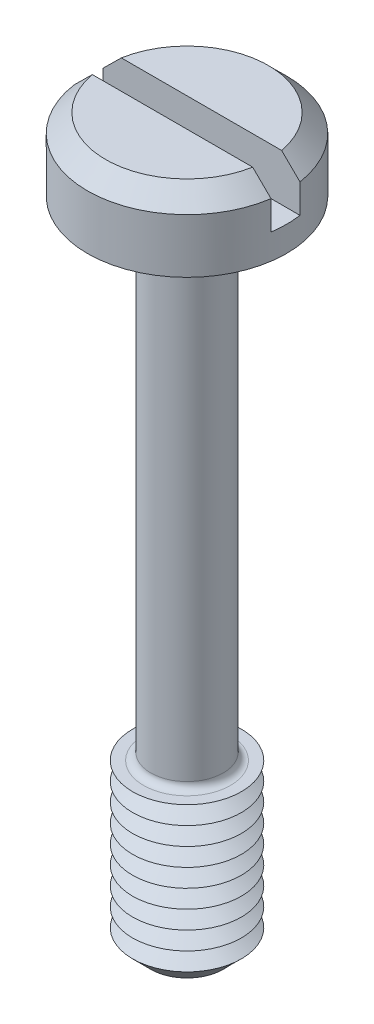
ISO-10303-21;
HEADER;
FILE_DESCRIPTION(('STEP AP214'),'2;1');
FILE_NAME('part.step','',(''),(''),'','','');
FILE_SCHEMA(('AUTOMOTIVE_DESIGN { 1 0 10303 214 1 1 1 1 }'));
ENDSEC;
DATA;
#1=APPLICATION_CONTEXT('core data for automotive mechanical design processes');
#2=APPLICATION_PROTOCOL_DEFINITION('international standard','automotive_design',2000,#1);
#3=PRODUCT_CONTEXT('',#1,'mechanical');
#4=PRODUCT('Part','Part','',(#3));
#5=PRODUCT_RELATED_PRODUCT_CATEGORY('part','',(#4));
#6=PRODUCT_DEFINITION_FORMATION('','',#4);
#7=PRODUCT_DEFINITION_CONTEXT('part definition',#1,'design');
#8=PRODUCT_DEFINITION('design','',#6,#7);
#9=PRODUCT_DEFINITION_SHAPE('','',#8);
#10=(LENGTH_UNIT() NAMED_UNIT(*) SI_UNIT(.MILLI.,.METRE.));
#11=(NAMED_UNIT(*) PLANE_ANGLE_UNIT() SI_UNIT($,.RADIAN.));
#12=(NAMED_UNIT(*) SI_UNIT($,.STERADIAN.) SOLID_ANGLE_UNIT());
#13=UNCERTAINTY_MEASURE_WITH_UNIT(LENGTH_MEASURE(1.E-05),#10,'distance_accuracy_value','');
#14=(GEOMETRIC_REPRESENTATION_CONTEXT(3) GLOBAL_UNCERTAINTY_ASSIGNED_CONTEXT((#13)) GLOBAL_UNIT_ASSIGNED_CONTEXT((#10,
#11,#12)) REPRESENTATION_CONTEXT('',''));
#15=CARTESIAN_POINT('',(0.,0.,0.));
#16=DIRECTION('',(0.,0.,1.));
#17=DIRECTION('',(1.,0.,0.));
#18=AXIS2_PLACEMENT_3D('',#15,#16,#17);
#19=CARTESIAN_POINT('',(0.,2.,0.));
#20=DIRECTION('',(0.,1.,0.));
#21=DIRECTION('',(0.,0.,1.));
#22=AXIS2_PLACEMENT_3D('',#19,#20,#21);
#23=PLANE('',#22);
#24=DIRECTION('',(-1.,0.,0.));
#25=VECTOR('',#24,1.);
#26=CARTESIAN_POINT('',(2.75,2.,-0.4));
#27=LINE('',#26,#25);
#28=CARTESIAN_POINT('',(2.21415898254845,2.,-0.4));
#29=VERTEX_POINT('',#28);
#30=CARTESIAN_POINT('',(-2.21415898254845,2.,-0.4));
#31=VERTEX_POINT('',#30);
#32=EDGE_CURVE('E110',#29,#31,#27,.T.);
#33=ORIENTED_EDGE('',*,*,#32,.F.);
#34=CARTESIAN_POINT('',(0.,2.,0.));
#35=DIRECTION('',(0.,1.,0.));
#36=DIRECTION('',(0.,0.,1.));
#37=AXIS2_PLACEMENT_3D('',#34,#35,#36);
#38=CIRCLE('',#37,2.25);
#39=EDGE_CURVE('E113',#29,#31,#38,.T.);
#40=ORIENTED_EDGE('',*,*,#39,.T.);
#41=EDGE_LOOP('',(#33,#40));
#42=FACE_BOUND('',#41,.T.);
#43=ADVANCED_FACE('F39',(#42),#23,.T.);
#44=CARTESIAN_POINT('',(0.,2.,0.));
#45=DIRECTION('',(0.,-1.,0.));
#46=DIRECTION('',(0.,0.,-1.));
#47=AXIS2_PLACEMENT_3D('',#44,#45,#46);
#48=CONICAL_SURFACE('',#47,2.25,0.785398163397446);
#49=CARTESIAN_POINT('',(6.05060089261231,-1.81380830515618,-0.4));
#50=CARTESIAN_POINT('',(5.84217393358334,-1.60583904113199,-0.4));
#51=CARTESIAN_POINT('',(5.63372707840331,-1.3978896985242,-0.4));
#52=CARTESIAN_POINT('',(5.21676338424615,-0.982052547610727,-0.4));
#53=CARTESIAN_POINT('',(5.00824654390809,-0.774164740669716,-0.4));
#54=CARTESIAN_POINT('',(4.59102343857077,-0.358383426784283,-0.4));
#55=CARTESIAN_POINT('',(4.38231713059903,-0.150489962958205,-0.4));
#56=CARTESIAN_POINT('',(3.96477014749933,0.265153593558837,-0.4));
#57=CARTESIAN_POINT('',(3.75592947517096,0.472903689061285,-0.4));
#58=CARTESIAN_POINT('',(3.33589913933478,0.89028798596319,-0.4));
#59=CARTESIAN_POINT('',(3.12470717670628,1.09991987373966,-0.4));
#60=CARTESIAN_POINT('',(2.7019134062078,1.51879562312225,-0.4));
#61=CARTESIAN_POINT('',(2.49031157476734,1.72803946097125,-0.4));
#62=CARTESIAN_POINT('',(2.17231429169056,2.04123939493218,-0.4));
#63=CARTESIAN_POINT('',(2.06623184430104,2.14551302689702,-0.4));
#64=CARTESIAN_POINT('',(1.85373145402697,2.35372301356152,-0.4));
#65=CARTESIAN_POINT('',(1.74731350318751,2.45765936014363,-0.4));
#66=CARTESIAN_POINT('',(1.53394692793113,2.6649644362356,-0.4));
#67=CARTESIAN_POINT('',(1.42699836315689,2.76833322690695,-0.4));
#68=CARTESIAN_POINT('',(1.26580938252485,2.92258234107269,-0.4));
#69=CARTESIAN_POINT('',(1.21195308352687,2.97386371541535,-0.4));
#70=CARTESIAN_POINT('',(1.10386632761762,3.07603025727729,-0.4));
#71=CARTESIAN_POINT('',(1.0496358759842,3.126915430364,-0.4));
#72=CARTESIAN_POINT('',(0.965529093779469,3.20495157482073,-0.4));
#73=CARTESIAN_POINT('',(0.935852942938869,3.23231811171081,-0.4));
#74=CARTESIAN_POINT('',(0.876282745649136,3.28681446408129,-0.4));
#75=CARTESIAN_POINT('',(0.846388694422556,3.31394427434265,-0.4));
#76=CARTESIAN_POINT('',(0.786319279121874,3.36788760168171,-0.4));
#77=CARTESIAN_POINT('',(0.756143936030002,3.39470114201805,-0.4));
#78=CARTESIAN_POINT('',(0.695411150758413,3.44788757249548,-0.4));
#79=CARTESIAN_POINT('',(0.664853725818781,3.4742604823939,-0.4));
#80=CARTESIAN_POINT('',(0.587773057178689,3.53947080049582,-0.4));
#81=CARTESIAN_POINT('',(0.540923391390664,3.57793090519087,-0.4));
#82=CARTESIAN_POINT('',(0.469108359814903,3.63368803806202,-0.4));
#83=CARTESIAN_POINT('',(0.444902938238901,3.65195872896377,-0.4));
#84=CARTESIAN_POINT('',(0.395796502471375,3.68753467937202,-0.4));
#85=CARTESIAN_POINT('',(0.370895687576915,3.70484021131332,-0.4));
#86=CARTESIAN_POINT('',(0.315135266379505,3.74129905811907,-0.4));
#87=CARTESIAN_POINT('',(0.284069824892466,3.76014262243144,-0.4));
#88=CARTESIAN_POINT('',(0.220007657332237,3.79429188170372,-0.4));
#89=CARTESIAN_POINT('',(0.187014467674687,3.80960381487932,-0.4));
#90=CARTESIAN_POINT('',(0.129469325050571,3.83013103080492,-0.4));
#91=CARTESIAN_POINT('',(0.105533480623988,3.83700748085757,-0.4));
#92=CARTESIAN_POINT('',(0.0568861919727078,3.84667143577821,-0.4));
#93=CARTESIAN_POINT('',(0.0321777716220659,3.84947323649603,-0.4));
#94=CARTESIAN_POINT('',(-0.017455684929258,3.85039131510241,-0.4));
#95=CARTESIAN_POINT('',(-0.0423811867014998,3.84848412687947,-0.4));
#96=CARTESIAN_POINT('',(-0.0915464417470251,3.8403829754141,-0.4));
#97=CARTESIAN_POINT('',(-0.115784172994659,3.83417751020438,-0.4));
#98=CARTESIAN_POINT('',(-0.16401593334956,3.81830420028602,-0.4));
#99=CARTESIAN_POINT('',(-0.18796977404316,3.80851974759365,-0.4));
#100=CARTESIAN_POINT('',(-0.234812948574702,3.78663483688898,-0.4));
#101=CARTESIAN_POINT('',(-0.257700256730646,3.77453017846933,-0.4));
#102=CARTESIAN_POINT('',(-0.302761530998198,3.74868049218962,-0.4));
#103=CARTESIAN_POINT('',(-0.324928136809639,3.73492286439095,-0.4));
#104=CARTESIAN_POINT('',(-0.368536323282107,3.70635481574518,-0.4));
#105=CARTESIAN_POINT('',(-0.389978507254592,3.69154530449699,-0.4));
#106=CARTESIAN_POINT('',(-0.457169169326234,3.64340388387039,-0.4));
#107=CARTESIAN_POINT('',(-0.501937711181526,3.60871473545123,-0.4));
#108=CARTESIAN_POINT('',(-0.590074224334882,3.53759028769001,-0.4));
#109=CARTESIAN_POINT('',(-0.633441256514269,3.50115385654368,-0.4));
#110=CARTESIAN_POINT('',(-0.719371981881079,3.42718980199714,-0.4));
#111=CARTESIAN_POINT('',(-0.761934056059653,3.3896603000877,-0.4));
#112=CARTESIAN_POINT('',(-0.846465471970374,3.31396862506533,-0.4));
#113=CARTESIAN_POINT('',(-0.888434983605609,3.27580664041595,-0.4));
#114=CARTESIAN_POINT('',(-1.01351008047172,3.16091722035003,-0.4));
#115=CARTESIAN_POINT('',(-1.09603733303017,3.0835613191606,-0.4));
#116=CARTESIAN_POINT('',(-1.26020205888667,2.92809304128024,-0.4));
#117=CARTESIAN_POINT('',(-1.3418403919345,2.84998156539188,-0.4));
#118=CARTESIAN_POINT('',(-1.50425180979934,2.69362860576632,-0.4));
#119=CARTESIAN_POINT('',(-1.58502715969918,2.61538947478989,-0.4));
#120=CARTESIAN_POINT('',(-1.74627332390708,2.45859784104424,-0.4));
#121=CARTESIAN_POINT('',(-1.82674413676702,2.38004533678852,-0.4));
#122=CARTESIAN_POINT('',(-2.06785619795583,2.14407469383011,-0.4));
#123=CARTESIAN_POINT('',(-2.22819388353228,1.98634651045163,-0.4));
#124=CARTESIAN_POINT('',(-2.54852691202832,1.67040441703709,-0.4));
#125=CARTESIAN_POINT('',(-2.70852207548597,1.51219032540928,-0.4));
#126=CARTESIAN_POINT('',(-3.02826273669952,1.19551306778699,-0.4));
#127=CARTESIAN_POINT('',(-3.18800823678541,1.03704990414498,-0.4));
#128=CARTESIAN_POINT('',(-3.6669908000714,0.561455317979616,-0.4));
#129=CARTESIAN_POINT('',(-3.98599924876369,0.244093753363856,-0.4));
#130=CARTESIAN_POINT('',(-4.6236988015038,-0.390879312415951,-0.4));
#131=CARTESIAN_POINT('',(-4.94238993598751,-0.708490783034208,-0.4));
#132=CARTESIAN_POINT('',(-5.39262624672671,-1.15743192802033,-0.4));
#133=CARTESIAN_POINT('',(-5.52423897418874,-1.28869385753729,-0.4));
#134=CARTESIAN_POINT('',(-5.78743776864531,-1.5512369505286,-0.4));
#135=CARTESIAN_POINT('',(-5.91902383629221,-1.68251811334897,-0.4));
#136=CARTESIAN_POINT('',(-6.05060089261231,-1.81380830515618,-0.4));
#137=B_SPLINE_CURVE_WITH_KNOTS('',3,(#49,#50,#51,#52,#53,#54,#55,#56,#57,#58,#59,#60,#61,#62,
#63,#64,#65,#66,#67,#68,#69,#70,#71,#72,#73,#74,#75,#76,#77,#78,#79,#80,#81,#82,#83,#84,#85,#86,
#87,#88,#89,#90,#91,#92,#93,#94,#95,#96,#97,#98,#99,#100,#101,#102,#103,#104,#105,#106,#107,
#108,#109,#110,#111,#112,#113,#114,#115,#116,#117,#118,#119,#120,#121,#122,#123,#124,#125,#126,
#127,#128,#129,#130,#131,#132,#133,#134,#135,#136),.UNSPECIFIED.,.F.,.F.,(4,2,2,2,2,2,2,2,2,2,2,
2,2,2,2,2,2,2,2,2,2,2,2,2,2,2,2,2,2,2,2,2,2,2,2,2,2,2,2,2,2,2,2,4),(0.,0.883310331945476,
1.76663897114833,2.6503821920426,3.53410755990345,4.42681573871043,5.31957687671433,
5.76582544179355,6.21208466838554,6.65829482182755,6.88139126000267,7.10448455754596,
7.22558850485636,7.34669511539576,7.46779276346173,7.58888496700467,7.77066509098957,
7.86163037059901,7.95256984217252,8.06146372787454,8.17016376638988,8.24461141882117,
8.31879723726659,8.39335348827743,8.46811002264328,8.54555790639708,8.62314734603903,
8.70137101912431,8.77952785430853,8.94932745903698,9.11923857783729,9.28946128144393,
9.45963414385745,9.79895964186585,10.1379210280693,10.475282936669,10.8126464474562,
11.4873867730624,12.1624208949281,12.8374486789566,14.1873973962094,15.5372009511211,
16.0948428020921,16.6524687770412),.UNSPECIFIED.);
#138=CARTESIAN_POINT('',(2.72075357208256,1.5,-0.4));
#139=VERTEX_POINT('',#138);
#140=EDGE_CURVE('E258',#139,#29,#137,.T.);
#141=ORIENTED_EDGE('',*,*,#140,.F.);
#142=CARTESIAN_POINT('',(0.,1.5,0.));
#143=DIRECTION('',(0.,1.,0.));
#144=DIRECTION('',(0.,0.,1.));
#145=AXIS2_PLACEMENT_3D('',#142,#143,#144);
#146=CIRCLE('',#145,2.75);
#147=CARTESIAN_POINT('',(-2.72075357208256,1.5,-0.4));
#148=VERTEX_POINT('',#147);
#149=EDGE_CURVE('E126',#148,#139,#146,.F.);
#150=ORIENTED_EDGE('',*,*,#149,.F.);
#151=EDGE_CURVE('E102',#31,#148,#137,.T.);
#152=ORIENTED_EDGE('',*,*,#151,.F.);
#153=ORIENTED_EDGE('',*,*,#39,.F.);
#154=EDGE_LOOP('',(#141,#150,#152,#153));
#155=FACE_BOUND('',#154,.T.);
#156=ADVANCED_FACE('F220',(#155),#48,.T.);
#157=CARTESIAN_POINT('',(0.,-18.,0.));
#158=DIRECTION('',(0.,1.,0.));
#159=DIRECTION('',(0.,0.,1.));
#160=AXIS2_PLACEMENT_3D('',#157,#158,#159);
#161=CYLINDRICAL_SURFACE('',#160,1.);
#162=CARTESIAN_POINT('',(0.,-13.3,0.));
#163=DIRECTION('',(0.,-1.,0.));
#164=DIRECTION('',(0.,0.,-1.));
#165=AXIS2_PLACEMENT_3D('',#162,#163,#164);
#166=CIRCLE('',#165,1.);
#167=CARTESIAN_POINT('',(0.,-13.3,-1.));
#168=VERTEX_POINT('',#167);
#169=EDGE_CURVE('E121',#168,#168,#166,.F.);
#170=ORIENTED_EDGE('',*,*,#169,.T.);
#171=EDGE_LOOP('',(#170));
#172=FACE_BOUND('',#171,.T.);
#173=CARTESIAN_POINT('',(0.,-0.199999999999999,0.));
#174=DIRECTION('',(0.,1.,0.));
#175=DIRECTION('',(0.,0.,1.));
#176=AXIS2_PLACEMENT_3D('',#173,#174,#175);
#177=CIRCLE('',#176,1.);
#178=CARTESIAN_POINT('',(0.,-0.199999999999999,1.));
#179=VERTEX_POINT('',#178);
#180=EDGE_CURVE('E365',#179,#179,#177,.F.);
#181=ORIENTED_EDGE('',*,*,#180,.T.);
#182=EDGE_LOOP('',(#181));
#183=FACE_BOUND('',#182,.T.);
#184=ADVANCED_FACE('F216',(#172,#183),#161,.T.);
#185=CARTESIAN_POINT('',(0.,2.,0.));
#186=DIRECTION('',(0.,-1.,0.));
#187=DIRECTION('',(0.,0.,-1.));
#188=AXIS2_PLACEMENT_3D('',#185,#186,#187);
#189=CYLINDRICAL_SURFACE('',#188,2.75);
#190=ORIENTED_EDGE('',*,*,#149,.T.);
#191=DIRECTION('',(0.,-1.,0.));
#192=VECTOR('',#191,1.);
#193=CARTESIAN_POINT('',(2.72075357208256,2.,-0.4));
#194=LINE('',#193,#192);
#195=CARTESIAN_POINT('',(2.72075357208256,0.7,-0.4));
#196=VERTEX_POINT('',#195);
#197=EDGE_CURVE('E64',#139,#196,#194,.T.);
#198=ORIENTED_EDGE('',*,*,#197,.T.);
#199=CARTESIAN_POINT('',(0.,0.7,0.));
#200=DIRECTION('',(0.,1.,0.));
#201=DIRECTION('',(0.,0.,1.));
#202=AXIS2_PLACEMENT_3D('',#199,#200,#201);
#203=CIRCLE('',#202,2.75);
#204=CARTESIAN_POINT('',(2.72075357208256,0.7,0.4));
#205=VERTEX_POINT('',#204);
#206=EDGE_CURVE('E11',#205,#196,#203,.T.);
#207=ORIENTED_EDGE('',*,*,#206,.F.);
#208=DIRECTION('',(0.,-1.,0.));
#209=VECTOR('',#208,1.);
#210=CARTESIAN_POINT('',(2.72075357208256,2.,0.4));
#211=LINE('',#210,#209);
#212=CARTESIAN_POINT('',(2.72075357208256,1.5,0.4));
#213=VERTEX_POINT('',#212);
#214=EDGE_CURVE('E275',#205,#213,#211,.F.);
#215=ORIENTED_EDGE('',*,*,#214,.T.);
#216=CARTESIAN_POINT('',(-2.72075357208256,1.5,0.4));
#217=VERTEX_POINT('',#216);
#218=EDGE_CURVE('E119',#213,#217,#146,.F.);
#219=ORIENTED_EDGE('',*,*,#218,.T.);
#220=DIRECTION('',(0.,-1.,0.));
#221=VECTOR('',#220,1.);
#222=CARTESIAN_POINT('',(-2.72075357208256,2.,0.4));
#223=LINE('',#222,#221);
#224=CARTESIAN_POINT('',(-2.72075357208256,0.7,0.4));
#225=VERTEX_POINT('',#224);
#226=EDGE_CURVE('E96',#217,#225,#223,.T.);
#227=ORIENTED_EDGE('',*,*,#226,.T.);
#228=CARTESIAN_POINT('',(-2.72075357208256,0.7,-0.4));
#229=VERTEX_POINT('',#228);
#230=EDGE_CURVE('E44',#229,#225,#203,.T.);
#231=ORIENTED_EDGE('',*,*,#230,.F.);
#232=DIRECTION('',(0.,-1.,0.));
#233=VECTOR('',#232,1.);
#234=CARTESIAN_POINT('',(-2.72075357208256,2.,-0.4));
#235=LINE('',#234,#233);
#236=EDGE_CURVE('E280',#229,#148,#235,.F.);
#237=ORIENTED_EDGE('',*,*,#236,.T.);
#238=EDGE_LOOP('',(#190,#198,#207,#215,#219,#227,#231,#237));
#239=FACE_BOUND('',#238,.T.);
#240=CARTESIAN_POINT('',(0.,0.,0.));
#241=DIRECTION('',(0.,1.,0.));
#242=DIRECTION('',(0.,0.,1.));
#243=AXIS2_PLACEMENT_3D('',#240,#241,#242);
#244=CIRCLE('',#243,2.75);
#245=CARTESIAN_POINT('',(0.,0.,2.75));
#246=VERTEX_POINT('',#245);
#247=EDGE_CURVE('E354',#246,#246,#244,.T.);
#248=ORIENTED_EDGE('',*,*,#247,.T.);
#249=EDGE_LOOP('',(#248));
#250=FACE_BOUND('',#249,.T.);
#251=ADVANCED_FACE('F219',(#239,#250),#189,.T.);
#252=DIRECTION('',(1.,0.,0.));
#253=VECTOR('',#252,1.);
#254=CARTESIAN_POINT('',(2.75,2.,0.4));
#255=LINE('',#254,#253);
#256=CARTESIAN_POINT('',(-2.21415898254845,2.,0.4));
#257=VERTEX_POINT('',#256);
#258=CARTESIAN_POINT('',(2.21415898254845,2.,0.4));
#259=VERTEX_POINT('',#258);
#260=EDGE_CURVE('E56',#257,#259,#255,.T.);
#261=ORIENTED_EDGE('',*,*,#260,.F.);
#262=EDGE_CURVE('E108',#257,#259,#38,.T.);
#263=ORIENTED_EDGE('',*,*,#262,.T.);
#264=EDGE_LOOP('',(#261,#263));
#265=FACE_BOUND('',#264,.T.);
#266=ADVANCED_FACE('F107',(#265),#23,.T.);
#267=CARTESIAN_POINT('',(0.,0.,0.));
#268=DIRECTION('',(0.,1.,0.));
#269=DIRECTION('',(0.,0.,1.));
#270=AXIS2_PLACEMENT_3D('',#267,#268,#269);
#271=PLANE('',#270);
#272=CARTESIAN_POINT('',(0.,0.,0.));
#273=DIRECTION('',(0.,1.,0.));
#274=DIRECTION('',(0.,0.,1.));
#275=AXIS2_PLACEMENT_3D('',#272,#273,#274);
#276=CIRCLE('',#275,1.2);
#277=CARTESIAN_POINT('',(0.,0.,1.2));
#278=VERTEX_POINT('',#277);
#279=EDGE_CURVE('E114',#278,#278,#276,.T.);
#280=ORIENTED_EDGE('',*,*,#279,.T.);
#281=EDGE_LOOP('',(#280));
#282=FACE_BOUND('',#281,.T.);
#283=ORIENTED_EDGE('',*,*,#247,.F.);
#284=EDGE_LOOP('',(#283));
#285=FACE_BOUND('',#284,.T.);
#286=ADVANCED_FACE('F210',(#282,#285),#271,.F.);
#287=CARTESIAN_POINT('',(0.,-13.5,0.));
#288=DIRECTION('',(0.,-1.,0.));
#289=DIRECTION('',(0.,0.,-1.));
#290=AXIS2_PLACEMENT_3D('',#287,#288,#289);
#291=PLANE('',#290);
#292=CARTESIAN_POINT('',(0.,-13.5,0.));
#293=DIRECTION('',(0.,-1.,0.));
#294=DIRECTION('',(0.,0.,-1.));
#295=AXIS2_PLACEMENT_3D('',#292,#293,#294);
#296=CIRCLE('',#295,1.2);
#297=CARTESIAN_POINT('',(0.,-13.5,-1.2));
#298=VERTEX_POINT('',#297);
#299=EDGE_CURVE('E361',#298,#298,#296,.T.);
#300=ORIENTED_EDGE('',*,*,#299,.T.);
#301=EDGE_LOOP('',(#300));
#302=FACE_BOUND('',#301,.T.);
#303=CARTESIAN_POINT('',(0.,-13.5,0.));
#304=DIRECTION('',(0.,1.,0.));
#305=DIRECTION('',(0.,0.,1.));
#306=AXIS2_PLACEMENT_3D('',#303,#304,#305);
#307=CIRCLE('',#306,1.5);
#308=CARTESIAN_POINT('',(0.,-13.5,1.5));
#309=VERTEX_POINT('',#308);
#310=EDGE_CURVE('E350',#309,#309,#307,.T.);
#311=ORIENTED_EDGE('',*,*,#310,.T.);
#312=EDGE_LOOP('',(#311));
#313=FACE_BOUND('',#312,.T.);
#314=ADVANCED_FACE('F206',(#302,#313),#291,.F.);
#315=CARTESIAN_POINT('',(0.,-13.75,0.));
#316=DIRECTION('',(0.,1.,0.));
#317=DIRECTION('',(0.,0.,1.));
#318=AXIS2_PLACEMENT_3D('',#315,#316,#317);
#319=CONICAL_SURFACE('',#318,1.06698729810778,1.0471975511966);
#320=ORIENTED_EDGE('',*,*,#310,.F.);
#321=EDGE_LOOP('',(#320));
#322=FACE_BOUND('',#321,.T.);
#323=CARTESIAN_POINT('',(0.,-13.75,0.));
#324=DIRECTION('',(0.,1.,0.));
#325=DIRECTION('',(0.,0.,1.));
#326=AXIS2_PLACEMENT_3D('',#323,#324,#325);
#327=CIRCLE('',#326,1.06698729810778);
#328=CARTESIAN_POINT('',(0.,-13.75,1.06698729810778));
#329=VERTEX_POINT('',#328);
#330=EDGE_CURVE('E346',#329,#329,#327,.T.);
#331=ORIENTED_EDGE('',*,*,#330,.T.);
#332=EDGE_LOOP('',(#331));
#333=FACE_BOUND('',#332,.T.);
#334=ADVANCED_FACE('F202',(#322,#333),#319,.T.);
#335=CARTESIAN_POINT('',(0.,-14.,0.));
#336=DIRECTION('',(0.,-1.,0.));
#337=DIRECTION('',(0.,0.,-1.));
#338=AXIS2_PLACEMENT_3D('',#335,#336,#337);
#339=CONICAL_SURFACE('',#338,1.5,1.0471975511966);
#340=ORIENTED_EDGE('',*,*,#330,.F.);
#341=EDGE_LOOP('',(#340));
#342=FACE_BOUND('',#341,.T.);
#343=CARTESIAN_POINT('',(0.,-14.,0.));
#344=DIRECTION('',(0.,1.,0.));
#345=DIRECTION('',(0.,0.,1.));
#346=AXIS2_PLACEMENT_3D('',#343,#344,#345);
#347=CIRCLE('',#346,1.5);
#348=CARTESIAN_POINT('',(0.,-14.,1.5));
#349=VERTEX_POINT('',#348);
#350=EDGE_CURVE('E342',#349,#349,#347,.T.);
#351=ORIENTED_EDGE('',*,*,#350,.T.);
#352=EDGE_LOOP('',(#351));
#353=FACE_BOUND('',#352,.T.);
#354=ADVANCED_FACE('F198',(#342,#353),#339,.T.);
#355=CARTESIAN_POINT('',(0.,-14.25,0.));
#356=DIRECTION('',(0.,1.,0.));
#357=DIRECTION('',(0.,0.,1.));
#358=AXIS2_PLACEMENT_3D('',#355,#356,#357);
#359=CONICAL_SURFACE('',#358,1.06698729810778,1.0471975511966);
#360=ORIENTED_EDGE('',*,*,#350,.F.);
#361=EDGE_LOOP('',(#360));
#362=FACE_BOUND('',#361,.T.);
#363=CARTESIAN_POINT('',(0.,-14.25,0.));
#364=DIRECTION('',(0.,1.,0.));
#365=DIRECTION('',(0.,0.,1.));
#366=AXIS2_PLACEMENT_3D('',#363,#364,#365);
#367=CIRCLE('',#366,1.06698729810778);
#368=CARTESIAN_POINT('',(0.,-14.25,1.06698729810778));
#369=VERTEX_POINT('',#368);
#370=EDGE_CURVE('E338',#369,#369,#367,.T.);
#371=ORIENTED_EDGE('',*,*,#370,.T.);
#372=EDGE_LOOP('',(#371));
#373=FACE_BOUND('',#372,.T.);
#374=ADVANCED_FACE('F194',(#362,#373),#359,.T.);
#375=CARTESIAN_POINT('',(0.,-14.5,0.));
#376=DIRECTION('',(0.,-1.,0.));
#377=DIRECTION('',(0.,0.,-1.));
#378=AXIS2_PLACEMENT_3D('',#375,#376,#377);
#379=CONICAL_SURFACE('',#378,1.5,1.0471975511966);
#380=ORIENTED_EDGE('',*,*,#370,.F.);
#381=EDGE_LOOP('',(#380));
#382=FACE_BOUND('',#381,.T.);
#383=CARTESIAN_POINT('',(0.,-14.5,0.));
#384=DIRECTION('',(0.,1.,0.));
#385=DIRECTION('',(0.,0.,1.));
#386=AXIS2_PLACEMENT_3D('',#383,#384,#385);
#387=CIRCLE('',#386,1.5);
#388=CARTESIAN_POINT('',(0.,-14.5,1.5));
#389=VERTEX_POINT('',#388);
#390=EDGE_CURVE('E334',#389,#389,#387,.T.);
#391=ORIENTED_EDGE('',*,*,#390,.T.);
#392=EDGE_LOOP('',(#391));
#393=FACE_BOUND('',#392,.T.);
#394=ADVANCED_FACE('F190',(#382,#393),#379,.T.);
#395=CARTESIAN_POINT('',(0.,-14.75,0.));
#396=DIRECTION('',(0.,1.,0.));
#397=DIRECTION('',(0.,0.,1.));
#398=AXIS2_PLACEMENT_3D('',#395,#396,#397);
#399=CONICAL_SURFACE('',#398,1.06698729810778,1.0471975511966);
#400=ORIENTED_EDGE('',*,*,#390,.F.);
#401=EDGE_LOOP('',(#400));
#402=FACE_BOUND('',#401,.T.);
#403=CARTESIAN_POINT('',(0.,-14.75,0.));
#404=DIRECTION('',(0.,1.,0.));
#405=DIRECTION('',(0.,0.,1.));
#406=AXIS2_PLACEMENT_3D('',#403,#404,#405);
#407=CIRCLE('',#406,1.06698729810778);
#408=CARTESIAN_POINT('',(0.,-14.75,1.06698729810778));
#409=VERTEX_POINT('',#408);
#410=EDGE_CURVE('E330',#409,#409,#407,.T.);
#411=ORIENTED_EDGE('',*,*,#410,.T.);
#412=EDGE_LOOP('',(#411));
#413=FACE_BOUND('',#412,.T.);
#414=ADVANCED_FACE('F186',(#402,#413),#399,.T.);
#415=CARTESIAN_POINT('',(0.,-15.,0.));
#416=DIRECTION('',(0.,-1.,0.));
#417=DIRECTION('',(0.,0.,-1.));
#418=AXIS2_PLACEMENT_3D('',#415,#416,#417);
#419=CONICAL_SURFACE('',#418,1.5,1.0471975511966);
#420=ORIENTED_EDGE('',*,*,#410,.F.);
#421=EDGE_LOOP('',(#420));
#422=FACE_BOUND('',#421,.T.);
#423=CARTESIAN_POINT('',(0.,-15.,0.));
#424=DIRECTION('',(0.,1.,0.));
#425=DIRECTION('',(0.,0.,1.));
#426=AXIS2_PLACEMENT_3D('',#423,#424,#425);
#427=CIRCLE('',#426,1.5);
#428=CARTESIAN_POINT('',(0.,-15.,1.5));
#429=VERTEX_POINT('',#428);
#430=EDGE_CURVE('E326',#429,#429,#427,.T.);
#431=ORIENTED_EDGE('',*,*,#430,.T.);
#432=EDGE_LOOP('',(#431));
#433=FACE_BOUND('',#432,.T.);
#434=ADVANCED_FACE('F182',(#422,#433),#419,.T.);
#435=CARTESIAN_POINT('',(0.,-15.25,0.));
#436=DIRECTION('',(0.,1.,0.));
#437=DIRECTION('',(0.,0.,1.));
#438=AXIS2_PLACEMENT_3D('',#435,#436,#437);
#439=CONICAL_SURFACE('',#438,1.06698729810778,1.0471975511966);
#440=ORIENTED_EDGE('',*,*,#430,.F.);
#441=EDGE_LOOP('',(#440));
#442=FACE_BOUND('',#441,.T.);
#443=CARTESIAN_POINT('',(0.,-15.25,0.));
#444=DIRECTION('',(0.,1.,0.));
#445=DIRECTION('',(0.,0.,1.));
#446=AXIS2_PLACEMENT_3D('',#443,#444,#445);
#447=CIRCLE('',#446,1.06698729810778);
#448=CARTESIAN_POINT('',(0.,-15.25,1.06698729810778));
#449=VERTEX_POINT('',#448);
#450=EDGE_CURVE('E322',#449,#449,#447,.T.);
#451=ORIENTED_EDGE('',*,*,#450,.T.);
#452=EDGE_LOOP('',(#451));
#453=FACE_BOUND('',#452,.T.);
#454=ADVANCED_FACE('F178',(#442,#453),#439,.T.);
#455=CARTESIAN_POINT('',(0.,-15.5,0.));
#456=DIRECTION('',(0.,-1.,0.));
#457=DIRECTION('',(0.,0.,-1.));
#458=AXIS2_PLACEMENT_3D('',#455,#456,#457);
#459=CONICAL_SURFACE('',#458,1.5,1.0471975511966);
#460=ORIENTED_EDGE('',*,*,#450,.F.);
#461=EDGE_LOOP('',(#460));
#462=FACE_BOUND('',#461,.T.);
#463=CARTESIAN_POINT('',(0.,-15.5,0.));
#464=DIRECTION('',(0.,1.,0.));
#465=DIRECTION('',(0.,0.,1.));
#466=AXIS2_PLACEMENT_3D('',#463,#464,#465);
#467=CIRCLE('',#466,1.5);
#468=CARTESIAN_POINT('',(0.,-15.5,1.5));
#469=VERTEX_POINT('',#468);
#470=EDGE_CURVE('E318',#469,#469,#467,.T.);
#471=ORIENTED_EDGE('',*,*,#470,.T.);
#472=EDGE_LOOP('',(#471));
#473=FACE_BOUND('',#472,.T.);
#474=ADVANCED_FACE('F174',(#462,#473),#459,.T.);
#475=CARTESIAN_POINT('',(0.,-15.75,0.));
#476=DIRECTION('',(0.,1.,0.));
#477=DIRECTION('',(0.,0.,1.));
#478=AXIS2_PLACEMENT_3D('',#475,#476,#477);
#479=CONICAL_SURFACE('',#478,1.06698729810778,1.0471975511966);
#480=ORIENTED_EDGE('',*,*,#470,.F.);
#481=EDGE_LOOP('',(#480));
#482=FACE_BOUND('',#481,.T.);
#483=CARTESIAN_POINT('',(0.,-15.75,0.));
#484=DIRECTION('',(0.,1.,0.));
#485=DIRECTION('',(0.,0.,1.));
#486=AXIS2_PLACEMENT_3D('',#483,#484,#485);
#487=CIRCLE('',#486,1.06698729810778);
#488=CARTESIAN_POINT('',(0.,-15.75,1.06698729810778));
#489=VERTEX_POINT('',#488);
#490=EDGE_CURVE('E314',#489,#489,#487,.T.);
#491=ORIENTED_EDGE('',*,*,#490,.T.);
#492=EDGE_LOOP('',(#491));
#493=FACE_BOUND('',#492,.T.);
#494=ADVANCED_FACE('F170',(#482,#493),#479,.T.);
#495=CARTESIAN_POINT('',(0.,-16.,0.));
#496=DIRECTION('',(0.,-1.,0.));
#497=DIRECTION('',(0.,0.,-1.));
#498=AXIS2_PLACEMENT_3D('',#495,#496,#497);
#499=CONICAL_SURFACE('',#498,1.5,1.0471975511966);
#500=ORIENTED_EDGE('',*,*,#490,.F.);
#501=EDGE_LOOP('',(#500));
#502=FACE_BOUND('',#501,.T.);
#503=CARTESIAN_POINT('',(0.,-16.,0.));
#504=DIRECTION('',(0.,1.,0.));
#505=DIRECTION('',(0.,0.,1.));
#506=AXIS2_PLACEMENT_3D('',#503,#504,#505);
#507=CIRCLE('',#506,1.5);
#508=CARTESIAN_POINT('',(0.,-16.,1.5));
#509=VERTEX_POINT('',#508);
#510=EDGE_CURVE('E310',#509,#509,#507,.T.);
#511=ORIENTED_EDGE('',*,*,#510,.T.);
#512=EDGE_LOOP('',(#511));
#513=FACE_BOUND('',#512,.T.);
#514=ADVANCED_FACE('F166',(#502,#513),#499,.T.);
#515=CARTESIAN_POINT('',(0.,-16.25,0.));
#516=DIRECTION('',(0.,1.,0.));
#517=DIRECTION('',(0.,0.,1.));
#518=AXIS2_PLACEMENT_3D('',#515,#516,#517);
#519=CONICAL_SURFACE('',#518,1.06698729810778,1.0471975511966);
#520=ORIENTED_EDGE('',*,*,#510,.F.);
#521=EDGE_LOOP('',(#520));
#522=FACE_BOUND('',#521,.T.);
#523=CARTESIAN_POINT('',(0.,-16.25,0.));
#524=DIRECTION('',(0.,1.,0.));
#525=DIRECTION('',(0.,0.,1.));
#526=AXIS2_PLACEMENT_3D('',#523,#524,#525);
#527=CIRCLE('',#526,1.06698729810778);
#528=CARTESIAN_POINT('',(0.,-16.25,1.06698729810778));
#529=VERTEX_POINT('',#528);
#530=EDGE_CURVE('E306',#529,#529,#527,.T.);
#531=ORIENTED_EDGE('',*,*,#530,.T.);
#532=EDGE_LOOP('',(#531));
#533=FACE_BOUND('',#532,.T.);
#534=ADVANCED_FACE('F162',(#522,#533),#519,.T.);
#535=CARTESIAN_POINT('',(0.,-16.5,0.));
#536=DIRECTION('',(0.,-1.,0.));
#537=DIRECTION('',(0.,0.,-1.));
#538=AXIS2_PLACEMENT_3D('',#535,#536,#537);
#539=CONICAL_SURFACE('',#538,1.5,1.0471975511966);
#540=ORIENTED_EDGE('',*,*,#530,.F.);
#541=EDGE_LOOP('',(#540));
#542=FACE_BOUND('',#541,.T.);
#543=CARTESIAN_POINT('',(0.,-16.5,0.));
#544=DIRECTION('',(0.,1.,0.));
#545=DIRECTION('',(0.,0.,1.));
#546=AXIS2_PLACEMENT_3D('',#543,#544,#545);
#547=CIRCLE('',#546,1.5);
#548=CARTESIAN_POINT('',(0.,-16.5,1.5));
#549=VERTEX_POINT('',#548);
#550=EDGE_CURVE('E302',#549,#549,#547,.T.);
#551=ORIENTED_EDGE('',*,*,#550,.T.);
#552=EDGE_LOOP('',(#551));
#553=FACE_BOUND('',#552,.T.);
#554=ADVANCED_FACE('F158',(#542,#553),#539,.T.);
#555=CARTESIAN_POINT('',(0.,-16.75,0.));
#556=DIRECTION('',(0.,1.,0.));
#557=DIRECTION('',(0.,0.,1.));
#558=AXIS2_PLACEMENT_3D('',#555,#556,#557);
#559=CONICAL_SURFACE('',#558,1.06698729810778,1.0471975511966);
#560=ORIENTED_EDGE('',*,*,#550,.F.);
#561=EDGE_LOOP('',(#560));
#562=FACE_BOUND('',#561,.T.);
#563=CARTESIAN_POINT('',(0.,-16.75,0.));
#564=DIRECTION('',(0.,1.,0.));
#565=DIRECTION('',(0.,0.,1.));
#566=AXIS2_PLACEMENT_3D('',#563,#564,#565);
#567=CIRCLE('',#566,1.06698729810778);
#568=CARTESIAN_POINT('',(0.,-16.75,1.06698729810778));
#569=VERTEX_POINT('',#568);
#570=EDGE_CURVE('E298',#569,#569,#567,.T.);
#571=ORIENTED_EDGE('',*,*,#570,.T.);
#572=EDGE_LOOP('',(#571));
#573=FACE_BOUND('',#572,.T.);
#574=ADVANCED_FACE('F154',(#562,#573),#559,.T.);
#575=CARTESIAN_POINT('',(0.,-17.,0.));
#576=DIRECTION('',(0.,-1.,0.));
#577=DIRECTION('',(0.,0.,-1.));
#578=AXIS2_PLACEMENT_3D('',#575,#576,#577);
#579=CONICAL_SURFACE('',#578,1.5,1.0471975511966);
#580=ORIENTED_EDGE('',*,*,#570,.F.);
#581=EDGE_LOOP('',(#580));
#582=FACE_BOUND('',#581,.T.);
#583=CARTESIAN_POINT('',(0.,-17.,0.));
#584=DIRECTION('',(0.,1.,0.));
#585=DIRECTION('',(0.,0.,1.));
#586=AXIS2_PLACEMENT_3D('',#583,#584,#585);
#587=CIRCLE('',#586,1.5);
#588=CARTESIAN_POINT('',(0.,-17.,1.5));
#589=VERTEX_POINT('',#588);
#590=EDGE_CURVE('E295',#589,#589,#587,.T.);
#591=ORIENTED_EDGE('',*,*,#590,.T.);
#592=EDGE_LOOP('',(#591));
#593=FACE_BOUND('',#592,.T.);
#594=ADVANCED_FACE('F150',(#582,#593),#579,.T.);
#595=CARTESIAN_POINT('',(0.,-17.25,0.));
#596=DIRECTION('',(0.,1.,0.));
#597=DIRECTION('',(0.,0.,1.));
#598=AXIS2_PLACEMENT_3D('',#595,#596,#597);
#599=CONICAL_SURFACE('',#598,1.06698729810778,1.0471975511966);
#600=ORIENTED_EDGE('',*,*,#590,.F.);
#601=EDGE_LOOP('',(#600));
#602=FACE_BOUND('',#601,.T.);
#603=CARTESIAN_POINT('',(0.,-17.25,0.));
#604=DIRECTION('',(0.,1.,0.));
#605=DIRECTION('',(0.,0.,1.));
#606=AXIS2_PLACEMENT_3D('',#603,#604,#605);
#607=CIRCLE('',#606,1.06698729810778);
#608=CARTESIAN_POINT('',(0.,-17.25,1.06698729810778));
#609=VERTEX_POINT('',#608);
#610=EDGE_CURVE('E292',#609,#609,#607,.T.);
#611=ORIENTED_EDGE('',*,*,#610,.T.);
#612=EDGE_LOOP('',(#611));
#613=FACE_BOUND('',#612,.T.);
#614=ADVANCED_FACE('F146',(#602,#613),#599,.T.);
#615=CARTESIAN_POINT('',(0.,-17.5,0.));
#616=DIRECTION('',(0.,-1.,0.));
#617=DIRECTION('',(0.,0.,-1.));
#618=AXIS2_PLACEMENT_3D('',#615,#616,#617);
#619=CONICAL_SURFACE('',#618,1.5,1.0471975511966);
#620=ORIENTED_EDGE('',*,*,#610,.F.);
#621=EDGE_LOOP('',(#620));
#622=FACE_BOUND('',#621,.T.);
#623=CARTESIAN_POINT('',(0.,-17.5,0.));
#624=DIRECTION('',(0.,1.,0.));
#625=DIRECTION('',(0.,0.,1.));
#626=AXIS2_PLACEMENT_3D('',#623,#624,#625);
#627=CIRCLE('',#626,1.5);
#628=CARTESIAN_POINT('',(0.,-17.5,1.5));
#629=VERTEX_POINT('',#628);
#630=EDGE_CURVE('E289',#629,#629,#627,.T.);
#631=ORIENTED_EDGE('',*,*,#630,.T.);
#632=EDGE_LOOP('',(#631));
#633=FACE_BOUND('',#632,.T.);
#634=ADVANCED_FACE('F142',(#622,#633),#619,.T.);
#635=CARTESIAN_POINT('',(0.,-18.,0.));
#636=DIRECTION('',(0.,-1.,0.));
#637=DIRECTION('',(0.,0.,-1.));
#638=AXIS2_PLACEMENT_3D('',#635,#636,#637);
#639=PLANE('',#638);
#640=CARTESIAN_POINT('',(0.,-18.,0.));
#641=DIRECTION('',(0.,-1.,0.));
#642=DIRECTION('',(0.,0.,-1.));
#643=AXIS2_PLACEMENT_3D('',#640,#641,#642);
#644=CIRCLE('',#643,1.);
#645=CARTESIAN_POINT('',(0.,-18.,-1.));
#646=VERTEX_POINT('',#645);
#647=EDGE_CURVE('E358',#646,#646,#644,.T.);
#648=ORIENTED_EDGE('',*,*,#647,.T.);
#649=EDGE_LOOP('',(#648));
#650=FACE_BOUND('',#649,.T.);
#651=ADVANCED_FACE('F145',(#650),#639,.T.);
#652=CARTESIAN_POINT('',(0.,-18.,0.));
#653=DIRECTION('',(0.,1.,0.));
#654=DIRECTION('',(0.,0.,1.));
#655=AXIS2_PLACEMENT_3D('',#652,#653,#654);
#656=CONICAL_SURFACE('',#655,1.,0.785398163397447);
#657=ORIENTED_EDGE('',*,*,#630,.F.);
#658=EDGE_LOOP('',(#657));
#659=FACE_BOUND('',#658,.T.);
#660=ORIENTED_EDGE('',*,*,#647,.F.);
#661=EDGE_LOOP('',(#660));
#662=FACE_BOUND('',#661,.T.);
#663=ADVANCED_FACE('F214',(#659,#662),#656,.T.);
#664=CARTESIAN_POINT('',(0.,-13.3,0.));
#665=DIRECTION('',(0.,-1.,0.));
#666=DIRECTION('',(0.,0.,-1.));
#667=AXIS2_PLACEMENT_3D('',#664,#665,#666);
#668=TOROIDAL_SURFACE('',#667,1.2,0.2);
#669=ORIENTED_EDGE('',*,*,#169,.F.);
#670=EDGE_LOOP('',(#669));
#671=FACE_BOUND('',#670,.T.);
#672=ORIENTED_EDGE('',*,*,#299,.F.);
#673=EDGE_LOOP('',(#672));
#674=FACE_BOUND('',#673,.T.);
#675=ADVANCED_FACE('F232',(#671,#674),#668,.F.);
#676=CARTESIAN_POINT('',(0.,-0.199999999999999,0.));
#677=DIRECTION('',(0.,1.,0.));
#678=DIRECTION('',(0.,0.,1.));
#679=AXIS2_PLACEMENT_3D('',#676,#677,#678);
#680=TOROIDAL_SURFACE('',#679,1.2,0.2);
#681=ORIENTED_EDGE('',*,*,#279,.F.);
#682=EDGE_LOOP('',(#681));
#683=FACE_BOUND('',#682,.T.);
#684=ORIENTED_EDGE('',*,*,#180,.F.);
#685=EDGE_LOOP('',(#684));
#686=FACE_BOUND('',#685,.T.);
#687=ADVANCED_FACE('F235',(#683,#686),#680,.F.);
#688=CARTESIAN_POINT('',(-6.05060089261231,-1.81380830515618,0.4));
#689=CARTESIAN_POINT('',(-5.84217393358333,-1.60583904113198,0.4));
#690=CARTESIAN_POINT('',(-5.63372707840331,-1.3978896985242,0.4));
#691=CARTESIAN_POINT('',(-5.21676338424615,-0.982052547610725,0.4));
#692=CARTESIAN_POINT('',(-5.00824654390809,-0.774164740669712,0.4));
#693=CARTESIAN_POINT('',(-4.59102343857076,-0.358383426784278,0.4));
#694=CARTESIAN_POINT('',(-4.38231713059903,-0.150489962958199,0.4));
#695=CARTESIAN_POINT('',(-3.96477014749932,0.265153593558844,0.4));
#696=CARTESIAN_POINT('',(-3.75592947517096,0.472903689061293,0.4));
#697=CARTESIAN_POINT('',(-3.33589913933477,0.890287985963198,0.4));
#698=CARTESIAN_POINT('',(-3.12470717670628,1.09991987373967,0.4));
#699=CARTESIAN_POINT('',(-2.7019134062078,1.51879562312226,0.4));
#700=CARTESIAN_POINT('',(-2.49031157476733,1.72803946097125,0.4));
#701=CARTESIAN_POINT('',(-2.17231429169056,2.04123939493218,0.4));
#702=CARTESIAN_POINT('',(-2.06623184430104,2.14551302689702,0.4));
#703=CARTESIAN_POINT('',(-1.85373145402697,2.35372301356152,0.4));
#704=CARTESIAN_POINT('',(-1.74731350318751,2.45765936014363,0.4));
#705=CARTESIAN_POINT('',(-1.53394692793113,2.6649644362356,0.4));
#706=CARTESIAN_POINT('',(-1.42699836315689,2.76833322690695,0.4));
#707=CARTESIAN_POINT('',(-1.26580938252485,2.92258234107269,0.4));
#708=CARTESIAN_POINT('',(-1.21195308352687,2.97386371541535,0.4));
#709=CARTESIAN_POINT('',(-1.10386632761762,3.07603025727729,0.4));
#710=CARTESIAN_POINT('',(-1.0496358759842,3.126915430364,0.4));
#711=CARTESIAN_POINT('',(-0.96552909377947,3.20495157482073,0.4));
#712=CARTESIAN_POINT('',(-0.935852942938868,3.23231811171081,0.4));
#713=CARTESIAN_POINT('',(-0.876282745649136,3.28681446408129,0.4));
#714=CARTESIAN_POINT('',(-0.846388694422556,3.31394427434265,0.4));
#715=CARTESIAN_POINT('',(-0.786319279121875,3.36788760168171,0.4));
#716=CARTESIAN_POINT('',(-0.756143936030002,3.39470114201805,0.4));
#717=CARTESIAN_POINT('',(-0.695411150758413,3.44788757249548,0.4));
#718=CARTESIAN_POINT('',(-0.664853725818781,3.4742604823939,0.4));
#719=CARTESIAN_POINT('',(-0.58777305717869,3.53947080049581,0.4));
#720=CARTESIAN_POINT('',(-0.540923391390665,3.57793090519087,0.4));
#721=CARTESIAN_POINT('',(-0.469108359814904,3.63368803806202,0.4));
#722=CARTESIAN_POINT('',(-0.444902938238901,3.65195872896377,0.4));
#723=CARTESIAN_POINT('',(-0.395796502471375,3.68753467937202,0.4));
#724=CARTESIAN_POINT('',(-0.370895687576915,3.70484021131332,0.4));
#725=CARTESIAN_POINT('',(-0.315135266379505,3.74129905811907,0.4));
#726=CARTESIAN_POINT('',(-0.284069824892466,3.76014262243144,0.4));
#727=CARTESIAN_POINT('',(-0.220007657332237,3.79429188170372,0.4));
#728=CARTESIAN_POINT('',(-0.187014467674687,3.80960381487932,0.4));
#729=CARTESIAN_POINT('',(-0.12946932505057,3.83013103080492,0.4));
#730=CARTESIAN_POINT('',(-0.105533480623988,3.83700748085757,0.4));
#731=CARTESIAN_POINT('',(-0.0568861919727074,3.84667143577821,0.4));
#732=CARTESIAN_POINT('',(-0.0321777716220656,3.84947323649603,0.4));
#733=CARTESIAN_POINT('',(0.0174556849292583,3.85039131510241,0.4));
#734=CARTESIAN_POINT('',(0.0423811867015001,3.84848412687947,0.4));
#735=CARTESIAN_POINT('',(0.0915464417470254,3.8403829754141,0.4));
#736=CARTESIAN_POINT('',(0.115784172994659,3.83417751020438,0.4));
#737=CARTESIAN_POINT('',(0.16401593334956,3.81830420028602,0.4));
#738=CARTESIAN_POINT('',(0.187969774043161,3.80851974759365,0.4));
#739=CARTESIAN_POINT('',(0.234812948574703,3.78663483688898,0.4));
#740=CARTESIAN_POINT('',(0.257700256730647,3.77453017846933,0.4));
#741=CARTESIAN_POINT('',(0.302761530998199,3.74868049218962,0.4));
#742=CARTESIAN_POINT('',(0.32492813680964,3.73492286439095,0.4));
#743=CARTESIAN_POINT('',(0.368536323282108,3.70635481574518,0.4));
#744=CARTESIAN_POINT('',(0.389978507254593,3.69154530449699,0.4));
#745=CARTESIAN_POINT('',(0.457169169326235,3.64340388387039,0.4));
#746=CARTESIAN_POINT('',(0.501937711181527,3.60871473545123,0.4));
#747=CARTESIAN_POINT('',(0.590074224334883,3.53759028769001,0.4));
#748=CARTESIAN_POINT('',(0.633441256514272,3.50115385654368,0.4));
#749=CARTESIAN_POINT('',(0.719371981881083,3.42718980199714,0.4));
#750=CARTESIAN_POINT('',(0.761934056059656,3.3896603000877,0.4));
#751=CARTESIAN_POINT('',(0.846465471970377,3.31396862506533,0.4));
#752=CARTESIAN_POINT('',(0.888434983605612,3.27580664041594,0.4));
#753=CARTESIAN_POINT('',(1.01351008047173,3.16091722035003,0.4));
#754=CARTESIAN_POINT('',(1.09603733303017,3.0835613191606,0.4));
#755=CARTESIAN_POINT('',(1.26020205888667,2.92809304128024,0.4));
#756=CARTESIAN_POINT('',(1.34184039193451,2.84998156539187,0.4));
#757=CARTESIAN_POINT('',(1.50425180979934,2.69362860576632,0.4));
#758=CARTESIAN_POINT('',(1.58502715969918,2.61538947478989,0.4));
#759=CARTESIAN_POINT('',(1.74627332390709,2.45859784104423,0.4));
#760=CARTESIAN_POINT('',(1.82674413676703,2.38004533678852,0.4));
#761=CARTESIAN_POINT('',(2.06785619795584,2.14407469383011,0.4));
#762=CARTESIAN_POINT('',(2.22819388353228,1.98634651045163,0.4));
#763=CARTESIAN_POINT('',(2.54852691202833,1.67040441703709,0.4));
#764=CARTESIAN_POINT('',(2.70852207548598,1.51219032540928,0.4));
#765=CARTESIAN_POINT('',(3.02826273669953,1.19551306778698,0.4));
#766=CARTESIAN_POINT('',(3.18800823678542,1.03704990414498,0.4));
#767=CARTESIAN_POINT('',(3.66699080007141,0.561455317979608,0.4));
#768=CARTESIAN_POINT('',(3.9859992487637,0.244093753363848,0.4));
#769=CARTESIAN_POINT('',(4.62369880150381,-0.39087931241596,0.4));
#770=CARTESIAN_POINT('',(4.94238993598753,-0.708490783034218,0.4));
#771=CARTESIAN_POINT('',(5.39262624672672,-1.15743192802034,0.4));
#772=CARTESIAN_POINT('',(5.52423897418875,-1.28869385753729,0.4));
#773=CARTESIAN_POINT('',(5.78743776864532,-1.5512369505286,0.4));
#774=CARTESIAN_POINT('',(5.91902383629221,-1.68251811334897,0.4));
#775=CARTESIAN_POINT('',(6.05060089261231,-1.81380830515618,0.4));
#776=B_SPLINE_CURVE_WITH_KNOTS('',3,(#688,#689,#690,#691,#692,#693,#694,#695,#696,#697,#698,
#699,#700,#701,#702,#703,#704,#705,#706,#707,#708,#709,#710,#711,#712,#713,#714,#715,#716,#717,
#718,#719,#720,#721,#722,#723,#724,#725,#726,#727,#728,#729,#730,#731,#732,#733,#734,#735,#736,
#737,#738,#739,#740,#741,#742,#743,#744,#745,#746,#747,#748,#749,#750,#751,#752,#753,#754,#755,
#756,#757,#758,#759,#760,#761,#762,#763,#764,#765,#766,#767,#768,#769,#770,#771,#772,#773,#774,
#775),.UNSPECIFIED.,.F.,.F.,(4,2,2,2,2,2,2,2,2,2,2,2,2,2,2,2,2,2,2,2,2,2,2,2,2,2,2,2,2,2,2,2,2,
2,2,2,2,2,2,2,2,2,2,4),(0.,0.883310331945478,1.76663897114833,2.65038219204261,3.53410755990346,
4.42681573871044,5.31957687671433,5.76582544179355,6.21208466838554,6.65829482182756,
6.88139126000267,7.10448455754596,7.22558850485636,7.34669511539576,7.46779276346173,
7.58888496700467,7.77066509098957,7.861630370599,7.95256984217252,8.06146372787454,
8.17016376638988,8.24461141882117,8.31879723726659,8.39335348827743,8.46811002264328,
8.54555790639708,8.62314734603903,8.70137101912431,8.77952785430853,8.94932745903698,
9.1192385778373,9.28946128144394,9.45963414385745,9.79895964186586,10.1379210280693,
10.475282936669,10.8126464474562,11.4873867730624,12.1624208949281,12.8374486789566,
14.1873973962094,15.5372009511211,16.0948428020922,16.6524687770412),.UNSPECIFIED.);
#777=EDGE_CURVE('E92',#217,#257,#776,.T.);
#778=ORIENTED_EDGE('',*,*,#777,.F.);
#779=ORIENTED_EDGE('',*,*,#218,.F.);
#780=EDGE_CURVE('E103',#259,#213,#776,.T.);
#781=ORIENTED_EDGE('',*,*,#780,.F.);
#782=ORIENTED_EDGE('',*,*,#262,.F.);
#783=EDGE_LOOP('',(#778,#779,#781,#782));
#784=FACE_BOUND('',#783,.T.);
#785=ADVANCED_FACE('F41',(#784),#48,.T.);
#786=CARTESIAN_POINT('',(0.,0.7,0.));
#787=DIRECTION('',(0.,1.,0.));
#788=DIRECTION('',(0.,0.,1.));
#789=AXIS2_PLACEMENT_3D('',#786,#787,#788);
#790=PLANE('',#789);
#791=DIRECTION('',(1.,0.,0.));
#792=VECTOR('',#791,1.);
#793=CARTESIAN_POINT('',(2.75,0.7,0.4));
#794=LINE('',#793,#792);
#795=EDGE_CURVE('E255',#225,#205,#794,.T.);
#796=ORIENTED_EDGE('',*,*,#795,.T.);
#797=ORIENTED_EDGE('',*,*,#206,.T.);
#798=DIRECTION('',(-1.,0.,0.));
#799=VECTOR('',#798,1.);
#800=CARTESIAN_POINT('',(2.75,0.7,-0.4));
#801=LINE('',#800,#799);
#802=EDGE_CURVE('E272',#196,#229,#801,.T.);
#803=ORIENTED_EDGE('',*,*,#802,.T.);
#804=ORIENTED_EDGE('',*,*,#230,.T.);
#805=EDGE_LOOP('',(#796,#797,#803,#804));
#806=FACE_BOUND('',#805,.T.);
#807=ADVANCED_FACE('F242',(#806),#790,.T.);
#808=CARTESIAN_POINT('',(2.75,0.7,-0.4));
#809=DIRECTION('',(0.,0.,-1.));
#810=DIRECTION('',(-1.,0.,0.));
#811=AXIS2_PLACEMENT_3D('',#808,#809,#810);
#812=PLANE('',#811);
#813=ORIENTED_EDGE('',*,*,#140,.T.);
#814=ORIENTED_EDGE('',*,*,#32,.T.);
#815=ORIENTED_EDGE('',*,*,#151,.T.);
#816=ORIENTED_EDGE('',*,*,#236,.F.);
#817=ORIENTED_EDGE('',*,*,#802,.F.);
#818=ORIENTED_EDGE('',*,*,#197,.F.);
#819=EDGE_LOOP('',(#813,#814,#815,#816,#817,#818));
#820=FACE_BOUND('',#819,.T.);
#821=ADVANCED_FACE('F139',(#820),#812,.F.);
#822=CARTESIAN_POINT('',(2.75,0.7,0.4));
#823=DIRECTION('',(0.,0.,1.));
#824=DIRECTION('',(1.,0.,0.));
#825=AXIS2_PLACEMENT_3D('',#822,#823,#824);
#826=PLANE('',#825);
#827=ORIENTED_EDGE('',*,*,#777,.T.);
#828=ORIENTED_EDGE('',*,*,#260,.T.);
#829=ORIENTED_EDGE('',*,*,#780,.T.);
#830=ORIENTED_EDGE('',*,*,#214,.F.);
#831=ORIENTED_EDGE('',*,*,#795,.F.);
#832=ORIENTED_EDGE('',*,*,#226,.F.);
#833=EDGE_LOOP('',(#827,#828,#829,#830,#831,#832));
#834=FACE_BOUND('',#833,.T.);
#835=ADVANCED_FACE('F93',(#834),#826,.F.);
#836=CLOSED_SHELL('',(#43,#156,#184,#251,#266,#286,#314,#334,#354,#374,#394,#414,#434,#454,#474,
#494,#514,#534,#554,#574,#594,#614,#634,#651,#663,#675,#687,#785,#807,#821,#835));
#837=MANIFOLD_SOLID_BREP('B2',#836);
#838=ADVANCED_BREP_SHAPE_REPRESENTATION('',(#18,#837),#14);
#839=SHAPE_DEFINITION_REPRESENTATION(#9,#838);
ENDSEC;
END-ISO-10303-21;
